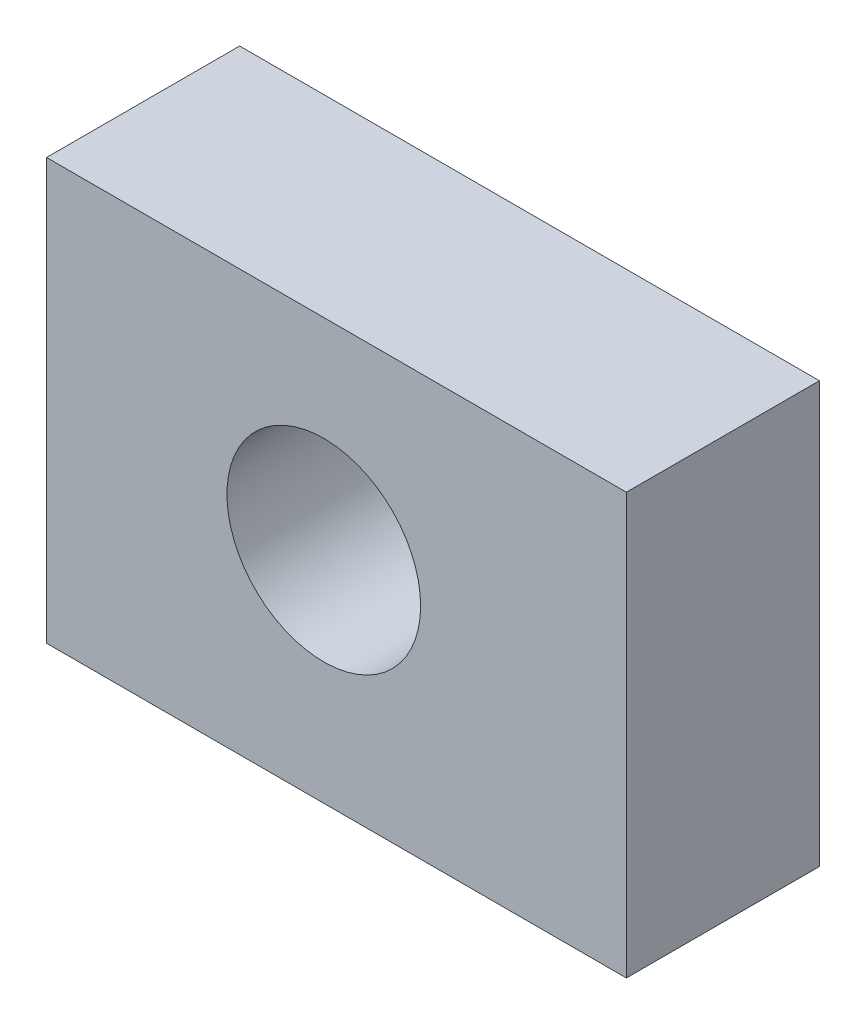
ISO-10303-21;
HEADER;
FILE_DESCRIPTION(('STEP AP214'),'2;1');
FILE_NAME('part.step','',(''),(''),'','','');
FILE_SCHEMA(('AUTOMOTIVE_DESIGN { 1 0 10303 214 1 1 1 1 }'));
ENDSEC;
DATA;
#1=APPLICATION_CONTEXT('core data for automotive mechanical design processes');
#2=APPLICATION_PROTOCOL_DEFINITION('international standard','automotive_design',2000,#1);
#3=PRODUCT_CONTEXT('',#1,'mechanical');
#4=PRODUCT('Part','Part','',(#3));
#5=PRODUCT_RELATED_PRODUCT_CATEGORY('part','',(#4));
#6=PRODUCT_DEFINITION_FORMATION('','',#4);
#7=PRODUCT_DEFINITION_CONTEXT('part definition',#1,'design');
#8=PRODUCT_DEFINITION('design','',#6,#7);
#9=PRODUCT_DEFINITION_SHAPE('','',#8);
#10=(LENGTH_UNIT() NAMED_UNIT(*) SI_UNIT(.MILLI.,.METRE.));
#11=(NAMED_UNIT(*) PLANE_ANGLE_UNIT() SI_UNIT($,.RADIAN.));
#12=(NAMED_UNIT(*) SI_UNIT($,.STERADIAN.) SOLID_ANGLE_UNIT());
#13=UNCERTAINTY_MEASURE_WITH_UNIT(LENGTH_MEASURE(1.E-05),#10,'distance_accuracy_value','');
#14=(GEOMETRIC_REPRESENTATION_CONTEXT(3) GLOBAL_UNCERTAINTY_ASSIGNED_CONTEXT((#13)) GLOBAL_UNIT_ASSIGNED_CONTEXT((#10,
#11,#12)) REPRESENTATION_CONTEXT('',''));
#15=CARTESIAN_POINT('',(0.,0.,0.));
#16=DIRECTION('',(0.,0.,1.));
#17=DIRECTION('',(1.,0.,0.));
#18=AXIS2_PLACEMENT_3D('',#15,#16,#17);
#19=CARTESIAN_POINT('',(0.,0.,16.51));
#20=DIRECTION('',(1.,0.,0.));
#21=DIRECTION('',(0.,0.,-1.));
#22=AXIS2_PLACEMENT_3D('',#19,#20,#21);
#23=PLANE('',#22);
#24=DIRECTION('',(0.,-1.,0.));
#25=VECTOR('',#24,1.);
#26=CARTESIAN_POINT('',(0.,0.,0.));
#27=LINE('',#26,#25);
#28=CARTESIAN_POINT('',(0.,35.9779903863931,0.));
#29=VERTEX_POINT('',#28);
#30=CARTESIAN_POINT('',(0.,0.,0.));
#31=VERTEX_POINT('',#30);
#32=EDGE_CURVE('E76',#29,#31,#27,.T.);
#33=ORIENTED_EDGE('',*,*,#32,.T.);
#34=DIRECTION('',(0.,0.,-1.));
#35=VECTOR('',#34,1.);
#36=CARTESIAN_POINT('',(0.,0.,16.51));
#37=LINE('',#36,#35);
#38=CARTESIAN_POINT('',(0.,0.,16.51));
#39=VERTEX_POINT('',#38);
#40=EDGE_CURVE('E11',#39,#31,#37,.T.);
#41=ORIENTED_EDGE('',*,*,#40,.F.);
#42=DIRECTION('',(0.,-1.,0.));
#43=VECTOR('',#42,1.);
#44=CARTESIAN_POINT('',(0.,0.,16.51));
#45=LINE('',#44,#43);
#46=CARTESIAN_POINT('',(0.,35.9779903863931,16.51));
#47=VERTEX_POINT('',#46);
#48=EDGE_CURVE('E99',#47,#39,#45,.T.);
#49=ORIENTED_EDGE('',*,*,#48,.F.);
#50=DIRECTION('',(0.,0.,-1.));
#51=VECTOR('',#50,1.);
#52=CARTESIAN_POINT('',(0.,35.9779903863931,16.51));
#53=LINE('',#52,#51);
#54=EDGE_CURVE('E88',#47,#29,#53,.T.);
#55=ORIENTED_EDGE('',*,*,#54,.T.);
#56=EDGE_LOOP('',(#33,#41,#49,#55));
#57=FACE_BOUND('',#56,.T.);
#58=ADVANCED_FACE('F32',(#57),#23,.F.);
#59=CARTESIAN_POINT('',(0.,0.,16.51));
#60=DIRECTION('',(0.,1.,0.));
#61=DIRECTION('',(0.,0.,1.));
#62=AXIS2_PLACEMENT_3D('',#59,#60,#61);
#63=PLANE('',#62);
#64=DIRECTION('',(1.,0.,0.));
#65=VECTOR('',#64,1.);
#66=CARTESIAN_POINT('',(0.,0.,0.));
#67=LINE('',#66,#65);
#68=CARTESIAN_POINT('',(49.5809761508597,0.,0.));
#69=VERTEX_POINT('',#68);
#70=EDGE_CURVE('E72',#31,#69,#67,.T.);
#71=ORIENTED_EDGE('',*,*,#70,.T.);
#72=DIRECTION('',(0.,0.,-1.));
#73=VECTOR('',#72,1.);
#74=CARTESIAN_POINT('',(49.5809761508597,0.,16.51));
#75=LINE('',#74,#73);
#76=CARTESIAN_POINT('',(49.5809761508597,0.,16.51));
#77=VERTEX_POINT('',#76);
#78=EDGE_CURVE('E39',#77,#69,#75,.T.);
#79=ORIENTED_EDGE('',*,*,#78,.F.);
#80=DIRECTION('',(1.,0.,0.));
#81=VECTOR('',#80,1.);
#82=CARTESIAN_POINT('',(0.,0.,16.51));
#83=LINE('',#82,#81);
#84=EDGE_CURVE('E84',#39,#77,#83,.T.);
#85=ORIENTED_EDGE('',*,*,#84,.F.);
#86=ORIENTED_EDGE('',*,*,#40,.T.);
#87=EDGE_LOOP('',(#71,#79,#85,#86));
#88=FACE_BOUND('',#87,.T.);
#89=ADVANCED_FACE('F83',(#88),#63,.F.);
#90=CARTESIAN_POINT('',(49.5809761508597,0.,16.51));
#91=DIRECTION('',(-1.,0.,0.));
#92=DIRECTION('',(0.,0.,1.));
#93=AXIS2_PLACEMENT_3D('',#90,#91,#92);
#94=PLANE('',#93);
#95=DIRECTION('',(0.,1.,0.));
#96=VECTOR('',#95,1.);
#97=CARTESIAN_POINT('',(49.5809761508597,0.,0.));
#98=LINE('',#97,#96);
#99=CARTESIAN_POINT('',(49.5809761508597,35.9779903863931,0.));
#100=VERTEX_POINT('',#99);
#101=EDGE_CURVE('E77',#69,#100,#98,.T.);
#102=ORIENTED_EDGE('',*,*,#101,.T.);
#103=DIRECTION('',(0.,0.,-1.));
#104=VECTOR('',#103,1.);
#105=CARTESIAN_POINT('',(49.5809761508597,35.9779903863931,16.51));
#106=LINE('',#105,#104);
#107=CARTESIAN_POINT('',(49.5809761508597,35.9779903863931,16.51));
#108=VERTEX_POINT('',#107);
#109=EDGE_CURVE('E105',#108,#100,#106,.T.);
#110=ORIENTED_EDGE('',*,*,#109,.F.);
#111=DIRECTION('',(0.,1.,0.));
#112=VECTOR('',#111,1.);
#113=CARTESIAN_POINT('',(49.5809761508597,0.,16.51));
#114=LINE('',#113,#112);
#115=EDGE_CURVE('E51',#77,#108,#114,.T.);
#116=ORIENTED_EDGE('',*,*,#115,.F.);
#117=ORIENTED_EDGE('',*,*,#78,.T.);
#118=EDGE_LOOP('',(#102,#110,#116,#117));
#119=FACE_BOUND('',#118,.T.);
#120=ADVANCED_FACE('F108',(#119),#94,.F.);
#121=CARTESIAN_POINT('',(0.,35.9779903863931,16.51));
#122=DIRECTION('',(0.,-1.,0.));
#123=DIRECTION('',(0.,0.,-1.));
#124=AXIS2_PLACEMENT_3D('',#121,#122,#123);
#125=PLANE('',#124);
#126=DIRECTION('',(-1.,0.,0.));
#127=VECTOR('',#126,1.);
#128=CARTESIAN_POINT('',(0.,35.9779903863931,0.));
#129=LINE('',#128,#127);
#130=EDGE_CURVE('E97',#100,#29,#129,.T.);
#131=ORIENTED_EDGE('',*,*,#130,.T.);
#132=ORIENTED_EDGE('',*,*,#54,.F.);
#133=DIRECTION('',(-1.,0.,0.));
#134=VECTOR('',#133,1.);
#135=CARTESIAN_POINT('',(0.,35.9779903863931,16.51));
#136=LINE('',#135,#134);
#137=EDGE_CURVE('E46',#108,#47,#136,.T.);
#138=ORIENTED_EDGE('',*,*,#137,.F.);
#139=ORIENTED_EDGE('',*,*,#109,.T.);
#140=EDGE_LOOP('',(#131,#132,#138,#139));
#141=FACE_BOUND('',#140,.T.);
#142=ADVANCED_FACE('F110',(#141),#125,.F.);
#143=CARTESIAN_POINT('',(0.,35.9779903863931,16.51));
#144=DIRECTION('',(0.,0.,-1.));
#145=DIRECTION('',(-1.,0.,0.));
#146=AXIS2_PLACEMENT_3D('',#143,#144,#145);
#147=PLANE('',#146);
#148=CARTESIAN_POINT('',(23.7056729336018,18.7511055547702,16.51));
#149=DIRECTION('',(0.,0.,1.));
#150=DIRECTION('',(1.,0.,0.));
#151=AXIS2_PLACEMENT_3D('',#148,#149,#150);
#152=CIRCLE('',#151,8.28021573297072);
#153=CARTESIAN_POINT('',(31.9858886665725,18.7511055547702,16.51));
#154=VERTEX_POINT('',#153);
#155=EDGE_CURVE('E92',#154,#154,#152,.T.);
#156=ORIENTED_EDGE('',*,*,#155,.F.);
#157=EDGE_LOOP('',(#156));
#158=FACE_BOUND('',#157,.T.);
#159=ORIENTED_EDGE('',*,*,#48,.T.);
#160=ORIENTED_EDGE('',*,*,#84,.T.);
#161=ORIENTED_EDGE('',*,*,#115,.T.);
#162=ORIENTED_EDGE('',*,*,#137,.T.);
#163=EDGE_LOOP('',(#159,#160,#161,#162));
#164=FACE_BOUND('',#163,.T.);
#165=ADVANCED_FACE('F111',(#158,#164),#147,.F.);
#166=CARTESIAN_POINT('',(0.,35.9779903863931,0.));
#167=DIRECTION('',(0.,0.,-1.));
#168=DIRECTION('',(-1.,0.,0.));
#169=AXIS2_PLACEMENT_3D('',#166,#167,#168);
#170=PLANE('',#169);
#171=CARTESIAN_POINT('',(23.7056729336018,18.7511055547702,0.));
#172=DIRECTION('',(0.,0.,1.));
#173=DIRECTION('',(1.,0.,0.));
#174=AXIS2_PLACEMENT_3D('',#171,#172,#173);
#175=CIRCLE('',#174,8.28021573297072);
#176=CARTESIAN_POINT('',(31.9858886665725,18.7511055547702,0.));
#177=VERTEX_POINT('',#176);
#178=EDGE_CURVE('E89',#177,#177,#175,.T.);
#179=ORIENTED_EDGE('',*,*,#178,.T.);
#180=EDGE_LOOP('',(#179));
#181=FACE_BOUND('',#180,.T.);
#182=ORIENTED_EDGE('',*,*,#32,.F.);
#183=ORIENTED_EDGE('',*,*,#130,.F.);
#184=ORIENTED_EDGE('',*,*,#101,.F.);
#185=ORIENTED_EDGE('',*,*,#70,.F.);
#186=EDGE_LOOP('',(#182,#183,#184,#185));
#187=FACE_BOUND('',#186,.T.);
#188=ADVANCED_FACE('F73',(#181,#187),#170,.T.);
#189=CARTESIAN_POINT('',(23.7056729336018,18.7511055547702,0.));
#190=DIRECTION('',(0.,0.,1.));
#191=DIRECTION('',(1.,0.,0.));
#192=AXIS2_PLACEMENT_3D('',#189,#190,#191);
#193=CYLINDRICAL_SURFACE('',#192,8.28021573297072);
#194=ORIENTED_EDGE('',*,*,#178,.F.);
#195=EDGE_LOOP('',(#194));
#196=FACE_BOUND('',#195,.T.);
#197=ORIENTED_EDGE('',*,*,#155,.T.);
#198=EDGE_LOOP('',(#197));
#199=FACE_BOUND('',#198,.T.);
#200=ADVANCED_FACE('F119',(#196,#199),#193,.F.);
#201=CLOSED_SHELL('',(#58,#89,#120,#142,#165,#188,#200));
#202=MANIFOLD_SOLID_BREP('B2',#201);
#203=ADVANCED_BREP_SHAPE_REPRESENTATION('',(#18,#202),#14);
#204=SHAPE_DEFINITION_REPRESENTATION(#9,#203);
ENDSEC;
END-ISO-10303-21;
